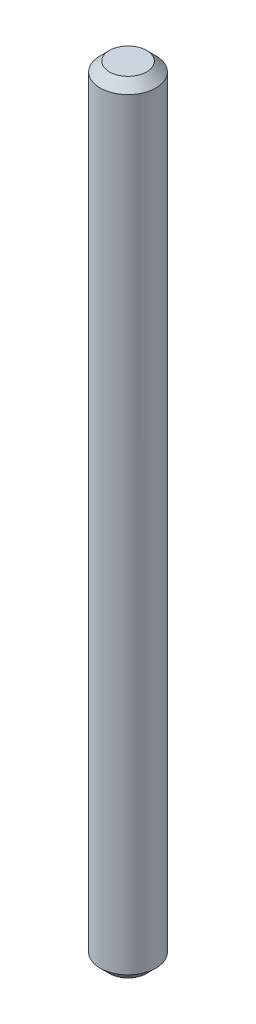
from build123d import *

# Parameters (mm, degrees)
SKETCH_1_R      = 0.75
EXTRUDE_1_DEPTH = 10.5
CHAMFER_1_SIZE  = 0.25


with BuildPart() as part:
    # Sketch 1 → Extrude 1 (new, symmetric)
    with BuildSketch(Plane(origin=(0, 0, 0), x_dir=(1, 0, 0), z_dir=(0, 1, 0))):
        with Locations(Location((0, 0, 0), (0, 0, 90))):
            Circle(SKETCH_1_R)
    extrude(amount=EXTRUDE_1_DEPTH, both=True)

    # Chamfer 1
    chamfer_1_edges = [part.edges().sort_by_distance(p)[0] for p in [
        (0, -10.5, 0.75),
        (0, 10.5, 0.75),
    ]]
    chamfer(chamfer_1_edges, length=CHAMFER_1_SIZE)


solid = part.part
